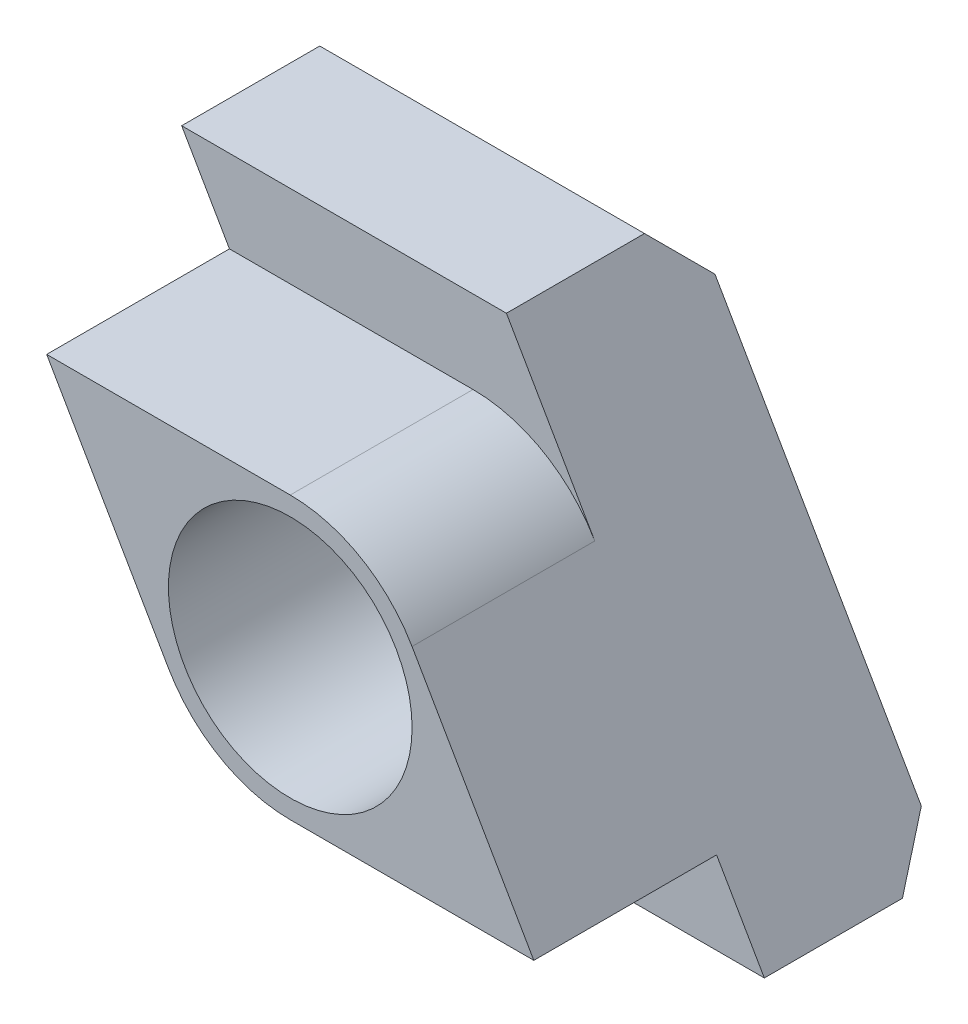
ISO-10303-21;
HEADER;
FILE_DESCRIPTION(('STEP AP214'),'2;1');
FILE_NAME('part.step','',(''),(''),'','','');
FILE_SCHEMA(('AUTOMOTIVE_DESIGN { 1 0 10303 214 1 1 1 1 }'));
ENDSEC;
DATA;
#1=APPLICATION_CONTEXT('core data for automotive mechanical design processes');
#2=APPLICATION_PROTOCOL_DEFINITION('international standard','automotive_design',2000,#1);
#3=PRODUCT_CONTEXT('',#1,'mechanical');
#4=PRODUCT('Part','Part','',(#3));
#5=PRODUCT_RELATED_PRODUCT_CATEGORY('part','',(#4));
#6=PRODUCT_DEFINITION_FORMATION('','',#4);
#7=PRODUCT_DEFINITION_CONTEXT('part definition',#1,'design');
#8=PRODUCT_DEFINITION('design','',#6,#7);
#9=PRODUCT_DEFINITION_SHAPE('','',#8);
#10=(LENGTH_UNIT() NAMED_UNIT(*) SI_UNIT(.MILLI.,.METRE.));
#11=(NAMED_UNIT(*) PLANE_ANGLE_UNIT() SI_UNIT($,.RADIAN.));
#12=(NAMED_UNIT(*) SI_UNIT($,.STERADIAN.) SOLID_ANGLE_UNIT());
#13=UNCERTAINTY_MEASURE_WITH_UNIT(LENGTH_MEASURE(1.E-05),#10,'distance_accuracy_value','');
#14=(GEOMETRIC_REPRESENTATION_CONTEXT(3) GLOBAL_UNCERTAINTY_ASSIGNED_CONTEXT((#13)) GLOBAL_UNIT_ASSIGNED_CONTEXT((#10,
#11,#12)) REPRESENTATION_CONTEXT('',''));
#15=CARTESIAN_POINT('',(0.,0.,0.));
#16=DIRECTION('',(0.,0.,1.));
#17=DIRECTION('',(1.,0.,0.));
#18=AXIS2_PLACEMENT_3D('',#15,#16,#17);
#19=CARTESIAN_POINT('',(5.45595572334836,13.85,0.));
#20=DIRECTION('',(0.,1.,0.));
#21=DIRECTION('',(-1.,0.,0.));
#22=AXIS2_PLACEMENT_3D('',#19,#20,#21);
#23=PLANE('',#22);
#24=DIRECTION('',(-1.,0.,0.));
#25=VECTOR('',#24,1.);
#26=CARTESIAN_POINT('',(23.9888925,13.85,18.));
#27=LINE('',#26,#25);
#28=CARTESIAN_POINT('',(0.,13.85,18.));
#29=VERTEX_POINT('',#28);
#30=CARTESIAN_POINT('',(-23.9888925,13.85,18.));
#31=VERTEX_POINT('',#30);
#32=EDGE_CURVE('E127',#29,#31,#27,.T.);
#33=ORIENTED_EDGE('',*,*,#32,.F.);
#34=DIRECTION('',(0.,0.,1.));
#35=VECTOR('',#34,1.);
#36=CARTESIAN_POINT('',(0.,13.8499975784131,-13.85));
#37=LINE('',#36,#35);
#38=CARTESIAN_POINT('',(0.,13.8499975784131,0.));
#39=VERTEX_POINT('',#38);
#40=EDGE_CURVE('E32',#39,#29,#37,.T.);
#41=ORIENTED_EDGE('',*,*,#40,.F.);
#42=DIRECTION('',(-1.,0.,0.));
#43=VECTOR('',#42,1.);
#44=CARTESIAN_POINT('',(-9.26646838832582,13.85,0.));
#45=LINE('',#44,#43);
#46=CARTESIAN_POINT('',(-23.9888925,13.85,0.));
#47=VERTEX_POINT('',#46);
#48=EDGE_CURVE('E18',#39,#47,#45,.T.);
#49=ORIENTED_EDGE('',*,*,#48,.T.);
#50=DIRECTION('',(0.,0.,1.));
#51=VECTOR('',#50,1.);
#52=CARTESIAN_POINT('',(-23.9888925,13.85,-18.));
#53=LINE('',#52,#51);
#54=EDGE_CURVE('E193',#31,#47,#53,.F.);
#55=ORIENTED_EDGE('',*,*,#54,.F.);
#56=EDGE_LOOP('',(#33,#41,#49,#55));
#57=FACE_BOUND('',#56,.T.);
#58=ADVANCED_FACE('F14',(#57),#23,.T.);
#59=CARTESIAN_POINT('',(-5.45595572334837,-13.85,0.));
#60=DIRECTION('',(0.,-1.,0.));
#61=DIRECTION('',(1.,0.,0.));
#62=AXIS2_PLACEMENT_3D('',#59,#60,#61);
#63=PLANE('',#62);
#64=DIRECTION('',(-1.,0.,0.));
#65=VECTOR('',#64,1.);
#66=CARTESIAN_POINT('',(23.9888925,-13.85,18.));
#67=LINE('',#66,#65);
#68=CARTESIAN_POINT('',(0.,-13.85,18.));
#69=VERTEX_POINT('',#68);
#70=CARTESIAN_POINT('',(23.9888925,-13.85,18.));
#71=VERTEX_POINT('',#70);
#72=EDGE_CURVE('E125',#69,#71,#67,.F.);
#73=ORIENTED_EDGE('',*,*,#72,.F.);
#74=DIRECTION('',(0.,0.,1.));
#75=VECTOR('',#74,1.);
#76=CARTESIAN_POINT('',(0.,-13.8499975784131,-13.85));
#77=LINE('',#76,#75);
#78=CARTESIAN_POINT('',(0.,-13.8499975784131,0.));
#79=VERTEX_POINT('',#78);
#80=EDGE_CURVE('E40',#79,#69,#77,.T.);
#81=ORIENTED_EDGE('',*,*,#80,.F.);
#82=DIRECTION('',(1.,0.,0.));
#83=VECTOR('',#82,1.);
#84=CARTESIAN_POINT('',(9.26646838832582,-13.85,0.));
#85=LINE('',#84,#83);
#86=CARTESIAN_POINT('',(23.9888925,-13.85,0.));
#87=VERTEX_POINT('',#86);
#88=EDGE_CURVE('E183',#79,#87,#85,.T.);
#89=ORIENTED_EDGE('',*,*,#88,.T.);
#90=DIRECTION('',(0.,0.,1.));
#91=VECTOR('',#90,1.);
#92=CARTESIAN_POINT('',(23.9888925,-13.85,-18.));
#93=LINE('',#92,#91);
#94=EDGE_CURVE('E216',#71,#87,#93,.F.);
#95=ORIENTED_EDGE('',*,*,#94,.F.);
#96=EDGE_LOOP('',(#73,#81,#89,#95));
#97=FACE_BOUND('',#96,.T.);
#98=ADVANCED_FACE('F347',(#97),#63,.T.);
#99=CARTESIAN_POINT('',(-28.694295,11.5891477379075,0.));
#100=DIRECTION('',(0.,0.,1.));
#101=DIRECTION('',(1.,0.,0.));
#102=AXIS2_PLACEMENT_3D('',#99,#100,#101);
#103=PLANE('',#102);
#104=ORIENTED_EDGE('',*,*,#48,.F.);
#105=CARTESIAN_POINT('',(0.,0.,0.));
#106=DIRECTION('',(0.,0.,1.));
#107=DIRECTION('',(1.,0.,0.));
#108=AXIS2_PLACEMENT_3D('',#105,#106,#107);
#109=CIRCLE('',#108,13.8499975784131);
#110=CARTESIAN_POINT('',(11.994451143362,6.92499636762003,0.));
#111=VERTEX_POINT('',#110);
#112=EDGE_CURVE('E120',#111,#39,#109,.T.);
#113=ORIENTED_EDGE('',*,*,#112,.F.);
#114=DIRECTION('',(0.499999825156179,-0.866025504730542,0.));
#115=VECTOR('',#114,1.);
#116=CARTESIAN_POINT('',(15.992595,0.,0.));
#117=LINE('',#116,#115);
#118=CARTESIAN_POINT('',(3.290895,22.,0.));
#119=VERTEX_POINT('',#118);
#120=EDGE_CURVE('E118',#119,#111,#117,.T.);
#121=ORIENTED_EDGE('',*,*,#120,.F.);
#122=DIRECTION('',(-1.,0.,0.));
#123=VECTOR('',#122,1.);
#124=CARTESIAN_POINT('',(3.290895,22.,0.));
#125=LINE('',#124,#123);
#126=CARTESIAN_POINT('',(-28.694295,22.,0.));
#127=VERTEX_POINT('',#126);
#128=EDGE_CURVE('E229',#127,#119,#125,.F.);
#129=ORIENTED_EDGE('',*,*,#128,.F.);
#130=DIRECTION('',(-0.499999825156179,0.866025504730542,0.));
#131=VECTOR('',#130,1.);
#132=CARTESIAN_POINT('',(-15.992595,0.,0.));
#133=LINE('',#132,#131);
#134=EDGE_CURVE('E197',#47,#127,#133,.T.);
#135=ORIENTED_EDGE('',*,*,#134,.F.);
#136=EDGE_LOOP('',(#104,#113,#121,#129,#135));
#137=FACE_BOUND('',#136,.T.);
#138=ADVANCED_FACE('F16',(#137),#103,.T.);
#139=CARTESIAN_POINT('',(3.290895,22.,0.));
#140=DIRECTION('',(0.,1.,0.));
#141=DIRECTION('',(0.,0.,-1.));
#142=AXIS2_PLACEMENT_3D('',#139,#140,#141);
#143=PLANE('',#142);
#144=DIRECTION('',(-1.,0.,0.));
#145=VECTOR('',#144,1.);
#146=CARTESIAN_POINT('',(5.831235,22.,-13.6));
#147=LINE('',#146,#145);
#148=CARTESIAN_POINT('',(-28.694295,22.,-13.6));
#149=VERTEX_POINT('',#148);
#150=CARTESIAN_POINT('',(3.290895,22.,-13.6));
#151=VERTEX_POINT('',#150);
#152=EDGE_CURVE('E232',#149,#151,#147,.F.);
#153=ORIENTED_EDGE('',*,*,#152,.F.);
#154=DIRECTION('',(0.,0.,1.));
#155=VECTOR('',#154,1.);
#156=CARTESIAN_POINT('',(-28.694295,22.,-18.));
#157=LINE('',#156,#155);
#158=EDGE_CURVE('E200',#127,#149,#157,.F.);
#159=ORIENTED_EDGE('',*,*,#158,.F.);
#160=ORIENTED_EDGE('',*,*,#128,.T.);
#161=DIRECTION('',(0.,0.,1.));
#162=VECTOR('',#161,1.);
#163=CARTESIAN_POINT('',(3.290895,22.,-18.));
#164=LINE('',#163,#162);
#165=EDGE_CURVE('E217',#151,#119,#164,.T.);
#166=ORIENTED_EDGE('',*,*,#165,.F.);
#167=EDGE_LOOP('',(#153,#159,#160,#166));
#168=FACE_BOUND('',#167,.T.);
#169=ADVANCED_FACE('F360',(#168),#143,.T.);
#170=CARTESIAN_POINT('',(6.03838818,22.,-13.6));
#171=DIRECTION('',(0.,0.707106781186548,-0.707106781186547));
#172=DIRECTION('',(0.,-0.707106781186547,-0.707106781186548));
#173=AXIS2_PLACEMENT_3D('',#170,#171,#172);
#174=PLANE('',#173);
#175=CARTESIAN_POINT('',(5.831235,17.6,-18.));
#176=CARTESIAN_POINT('',(5.7253875,17.7833333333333,-17.8166666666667));
#177=CARTESIAN_POINT('',(5.61954,17.9666666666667,-17.6333333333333));
#178=CARTESIAN_POINT('',(5.407845,18.3333333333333,-17.2666666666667));
#179=CARTESIAN_POINT('',(5.3019975,18.5166666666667,-17.0833333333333));
#180=CARTESIAN_POINT('',(5.0903025,18.8833333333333,-16.7166666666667));
#181=CARTESIAN_POINT('',(4.984455,19.0666666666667,-16.5333333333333));
#182=CARTESIAN_POINT('',(4.77276,19.4333333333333,-16.1666666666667));
#183=CARTESIAN_POINT('',(4.6669125,19.6166666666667,-15.9833333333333));
#184=CARTESIAN_POINT('',(4.4552175,19.9833333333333,-15.6166666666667));
#185=CARTESIAN_POINT('',(4.34937,20.1666666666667,-15.4333333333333));
#186=CARTESIAN_POINT('',(4.137675,20.5333333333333,-15.0666666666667));
#187=CARTESIAN_POINT('',(4.0318275,20.7166666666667,-14.8833333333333));
#188=CARTESIAN_POINT('',(3.8201325,21.0833333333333,-14.5166666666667));
#189=CARTESIAN_POINT('',(3.714285,21.2666666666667,-14.3333333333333));
#190=CARTESIAN_POINT('',(3.50259,21.6333333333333,-13.9666666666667));
#191=CARTESIAN_POINT('',(3.3967425,21.8166666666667,-13.7833333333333));
#192=CARTESIAN_POINT('',(3.290895,22.,-13.6));
#193=B_SPLINE_CURVE_WITH_KNOTS('',3,(#175,#176,#177,#178,#179,#180,#181,#182,#183,#184,#185,
#186,#187,#188,#189,#190,#191,#192),.UNSPECIFIED.,.F.,.F.,(4,2,2,2,2,2,2,2,4),(0.,
0.840138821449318,1.68027764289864,2.52041646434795,3.36055528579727,4.2006941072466,
5.04083292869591,5.88097175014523,6.72111057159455),.UNSPECIFIED.);
#194=CARTESIAN_POINT('',(5.831235,17.6,-18.));
#195=VERTEX_POINT('',#194);
#196=EDGE_CURVE('E226',#195,#151,#193,.T.);
#197=ORIENTED_EDGE('',*,*,#196,.F.);
#198=DIRECTION('',(-1.,0.,0.));
#199=VECTOR('',#198,1.);
#200=CARTESIAN_POINT('',(26.153955,17.6,-18.));
#201=LINE('',#200,#199);
#202=CARTESIAN_POINT('',(-26.153955,17.6,-18.));
#203=VERTEX_POINT('',#202);
#204=EDGE_CURVE('E205',#203,#195,#201,.F.);
#205=ORIENTED_EDGE('',*,*,#204,.F.);
#206=CARTESIAN_POINT('',(-28.694295,22.,-13.6));
#207=CARTESIAN_POINT('',(-28.5884475,21.8166666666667,-13.7833333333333));
#208=CARTESIAN_POINT('',(-28.4826,21.6333333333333,-13.9666666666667));
#209=CARTESIAN_POINT('',(-28.270905,21.2666666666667,-14.3333333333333));
#210=CARTESIAN_POINT('',(-28.1650575,21.0833333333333,-14.5166666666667));
#211=CARTESIAN_POINT('',(-27.9533625,20.7166666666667,-14.8833333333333));
#212=CARTESIAN_POINT('',(-27.847515,20.5333333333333,-15.0666666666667));
#213=CARTESIAN_POINT('',(-27.63582,20.1666666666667,-15.4333333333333));
#214=CARTESIAN_POINT('',(-27.5299725,19.9833333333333,-15.6166666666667));
#215=CARTESIAN_POINT('',(-27.3182775,19.6166666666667,-15.9833333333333));
#216=CARTESIAN_POINT('',(-27.21243,19.4333333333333,-16.1666666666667));
#217=CARTESIAN_POINT('',(-27.000735,19.0666666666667,-16.5333333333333));
#218=CARTESIAN_POINT('',(-26.8948875,18.8833333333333,-16.7166666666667));
#219=CARTESIAN_POINT('',(-26.6831925,18.5166666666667,-17.0833333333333));
#220=CARTESIAN_POINT('',(-26.577345,18.3333333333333,-17.2666666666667));
#221=CARTESIAN_POINT('',(-26.36565,17.9666666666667,-17.6333333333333));
#222=CARTESIAN_POINT('',(-26.2598025,17.7833333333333,-17.8166666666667));
#223=CARTESIAN_POINT('',(-26.153955,17.6,-18.));
#224=B_SPLINE_CURVE_WITH_KNOTS('',3,(#206,#207,#208,#209,#210,#211,#212,#213,#214,#215,#216,
#217,#218,#219,#220,#221,#222,#223),.UNSPECIFIED.,.F.,.F.,(4,2,2,2,2,2,2,2,4),(0.,
0.840138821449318,1.68027764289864,2.52041646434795,3.36055528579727,4.20069410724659,
5.04083292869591,5.88097175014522,6.72111057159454),.UNSPECIFIED.);
#225=EDGE_CURVE('E294',#149,#203,#224,.T.);
#226=ORIENTED_EDGE('',*,*,#225,.F.);
#227=ORIENTED_EDGE('',*,*,#152,.T.);
#228=EDGE_LOOP('',(#197,#205,#226,#227));
#229=FACE_BOUND('',#228,.T.);
#230=ADVANCED_FACE('F358',(#229),#174,.T.);
#231=CARTESIAN_POINT('',(28.90144818,-17.6,-18.));
#232=DIRECTION('',(0.,-0.707106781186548,-0.707106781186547));
#233=DIRECTION('',(0.,-0.707106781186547,0.707106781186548));
#234=AXIS2_PLACEMENT_3D('',#231,#232,#233);
#235=PLANE('',#234);
#236=CARTESIAN_POINT('',(28.694295,-22.,-13.6));
#237=CARTESIAN_POINT('',(28.5884475,-21.8166666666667,-13.7833333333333));
#238=CARTESIAN_POINT('',(28.4826,-21.6333333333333,-13.9666666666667));
#239=CARTESIAN_POINT('',(28.270905,-21.2666666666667,-14.3333333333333));
#240=CARTESIAN_POINT('',(28.1650575,-21.0833333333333,-14.5166666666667));
#241=CARTESIAN_POINT('',(27.9533625,-20.7166666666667,-14.8833333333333));
#242=CARTESIAN_POINT('',(27.847515,-20.5333333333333,-15.0666666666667));
#243=CARTESIAN_POINT('',(27.63582,-20.1666666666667,-15.4333333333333));
#244=CARTESIAN_POINT('',(27.5299725,-19.9833333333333,-15.6166666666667));
#245=CARTESIAN_POINT('',(27.3182775,-19.6166666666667,-15.9833333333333));
#246=CARTESIAN_POINT('',(27.21243,-19.4333333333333,-16.1666666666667));
#247=CARTESIAN_POINT('',(27.000735,-19.0666666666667,-16.5333333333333));
#248=CARTESIAN_POINT('',(26.8948875,-18.8833333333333,-16.7166666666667));
#249=CARTESIAN_POINT('',(26.6831925,-18.5166666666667,-17.0833333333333));
#250=CARTESIAN_POINT('',(26.577345,-18.3333333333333,-17.2666666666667));
#251=CARTESIAN_POINT('',(26.36565,-17.9666666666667,-17.6333333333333));
#252=CARTESIAN_POINT('',(26.2598025,-17.7833333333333,-17.8166666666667));
#253=CARTESIAN_POINT('',(26.153955,-17.6,-18.));
#254=B_SPLINE_CURVE_WITH_KNOTS('',3,(#236,#237,#238,#239,#240,#241,#242,#243,#244,#245,#246,
#247,#248,#249,#250,#251,#252,#253),.UNSPECIFIED.,.F.,.F.,(4,2,2,2,2,2,2,2,4),(0.,
0.840138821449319,1.68027764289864,2.52041646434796,3.36055528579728,4.2006941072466,
5.04083292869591,5.88097175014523,6.72111057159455),.UNSPECIFIED.);
#255=CARTESIAN_POINT('',(28.694295,-22.,-13.6));
#256=VERTEX_POINT('',#255);
#257=CARTESIAN_POINT('',(26.153955,-17.6,-18.));
#258=VERTEX_POINT('',#257);
#259=EDGE_CURVE('E260',#256,#258,#254,.T.);
#260=ORIENTED_EDGE('',*,*,#259,.F.);
#261=DIRECTION('',(-1.,0.,0.));
#262=VECTOR('',#261,1.);
#263=CARTESIAN_POINT('',(28.694295,-22.,-13.6));
#264=LINE('',#263,#262);
#265=CARTESIAN_POINT('',(-3.290895,-22.,-13.6));
#266=VERTEX_POINT('',#265);
#267=EDGE_CURVE('E206',#266,#256,#264,.F.);
#268=ORIENTED_EDGE('',*,*,#267,.F.);
#269=CARTESIAN_POINT('',(-5.831235,-17.6,-18.));
#270=CARTESIAN_POINT('',(-5.7253875,-17.7833333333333,-17.8166666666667));
#271=CARTESIAN_POINT('',(-5.61954,-17.9666666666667,-17.6333333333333));
#272=CARTESIAN_POINT('',(-5.407845,-18.3333333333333,-17.2666666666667));
#273=CARTESIAN_POINT('',(-5.3019975,-18.5166666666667,-17.0833333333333));
#274=CARTESIAN_POINT('',(-5.0903025,-18.8833333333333,-16.7166666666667));
#275=CARTESIAN_POINT('',(-4.984455,-19.0666666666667,-16.5333333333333));
#276=CARTESIAN_POINT('',(-4.77276,-19.4333333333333,-16.1666666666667));
#277=CARTESIAN_POINT('',(-4.6669125,-19.6166666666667,-15.9833333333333));
#278=CARTESIAN_POINT('',(-4.4552175,-19.9833333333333,-15.6166666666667));
#279=CARTESIAN_POINT('',(-4.34937,-20.1666666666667,-15.4333333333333));
#280=CARTESIAN_POINT('',(-4.137675,-20.5333333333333,-15.0666666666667));
#281=CARTESIAN_POINT('',(-4.0318275,-20.7166666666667,-14.8833333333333));
#282=CARTESIAN_POINT('',(-3.8201325,-21.0833333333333,-14.5166666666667));
#283=CARTESIAN_POINT('',(-3.714285,-21.2666666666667,-14.3333333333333));
#284=CARTESIAN_POINT('',(-3.50259,-21.6333333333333,-13.9666666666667));
#285=CARTESIAN_POINT('',(-3.3967425,-21.8166666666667,-13.7833333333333));
#286=CARTESIAN_POINT('',(-3.290895,-22.,-13.6));
#287=B_SPLINE_CURVE_WITH_KNOTS('',3,(#269,#270,#271,#272,#273,#274,#275,#276,#277,#278,#279,
#280,#281,#282,#283,#284,#285,#286),.UNSPECIFIED.,.F.,.F.,(4,2,2,2,2,2,2,2,4),(0.,
0.840138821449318,1.68027764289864,2.52041646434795,3.36055528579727,4.20069410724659,
5.0408329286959,5.88097175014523,6.72111057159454),.UNSPECIFIED.);
#288=CARTESIAN_POINT('',(-5.831235,-17.6,-18.));
#289=VERTEX_POINT('',#288);
#290=EDGE_CURVE('E212',#289,#266,#287,.T.);
#291=ORIENTED_EDGE('',*,*,#290,.F.);
#292=DIRECTION('',(-1.,0.,0.));
#293=VECTOR('',#292,1.);
#294=CARTESIAN_POINT('',(26.153955,-17.6,-18.));
#295=LINE('',#294,#293);
#296=EDGE_CURVE('E186',#258,#289,#295,.T.);
#297=ORIENTED_EDGE('',*,*,#296,.F.);
#298=EDGE_LOOP('',(#260,#268,#291,#297));
#299=FACE_BOUND('',#298,.T.);
#300=ADVANCED_FACE('F320',(#299),#235,.T.);
#301=CARTESIAN_POINT('',(28.694295,-22.,-13.6));
#302=DIRECTION('',(0.,-1.,0.));
#303=DIRECTION('',(0.,0.,1.));
#304=AXIS2_PLACEMENT_3D('',#301,#302,#303);
#305=PLANE('',#304);
#306=ORIENTED_EDGE('',*,*,#267,.T.);
#307=DIRECTION('',(0.,0.,1.));
#308=VECTOR('',#307,1.);
#309=CARTESIAN_POINT('',(28.694295,-22.,-18.));
#310=LINE('',#309,#308);
#311=CARTESIAN_POINT('',(28.694295,-22.,0.));
#312=VERTEX_POINT('',#311);
#313=EDGE_CURVE('E222',#312,#256,#310,.F.);
#314=ORIENTED_EDGE('',*,*,#313,.F.);
#315=DIRECTION('',(1.,0.,0.));
#316=VECTOR('',#315,1.);
#317=CARTESIAN_POINT('',(9.71391352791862,-22.,0.));
#318=LINE('',#317,#316);
#319=CARTESIAN_POINT('',(-3.290895,-22.,0.));
#320=VERTEX_POINT('',#319);
#321=EDGE_CURVE('E203',#320,#312,#318,.T.);
#322=ORIENTED_EDGE('',*,*,#321,.F.);
#323=DIRECTION('',(0.,0.,1.));
#324=VECTOR('',#323,1.);
#325=CARTESIAN_POINT('',(-3.290895,-22.,-18.));
#326=LINE('',#325,#324);
#327=EDGE_CURVE('E209',#266,#320,#326,.T.);
#328=ORIENTED_EDGE('',*,*,#327,.F.);
#329=EDGE_LOOP('',(#306,#314,#322,#328));
#330=FACE_BOUND('',#329,.T.);
#331=ADVANCED_FACE('F325',(#330),#305,.T.);
#332=CARTESIAN_POINT('',(-9.26646794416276,-22.,0.));
#333=DIRECTION('',(0.,0.,1.));
#334=DIRECTION('',(1.,0.,0.));
#335=AXIS2_PLACEMENT_3D('',#332,#333,#334);
#336=PLANE('',#335);
#337=ORIENTED_EDGE('',*,*,#88,.F.);
#338=CARTESIAN_POINT('',(0.,0.,0.));
#339=DIRECTION('',(0.,0.,1.));
#340=DIRECTION('',(1.,0.,0.));
#341=AXIS2_PLACEMENT_3D('',#338,#339,#340);
#342=CIRCLE('',#341,13.8499975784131);
#343=CARTESIAN_POINT('',(-11.994451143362,-6.92499636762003,0.));
#344=VERTEX_POINT('',#343);
#345=EDGE_CURVE('E233',#344,#79,#342,.T.);
#346=ORIENTED_EDGE('',*,*,#345,.F.);
#347=DIRECTION('',(-0.499999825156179,0.866025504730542,0.));
#348=VECTOR('',#347,1.);
#349=CARTESIAN_POINT('',(-15.992595,0.,0.));
#350=LINE('',#349,#348);
#351=EDGE_CURVE('E191',#320,#344,#350,.T.);
#352=ORIENTED_EDGE('',*,*,#351,.F.);
#353=ORIENTED_EDGE('',*,*,#321,.T.);
#354=DIRECTION('',(0.499999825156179,-0.866025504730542,0.));
#355=VECTOR('',#354,1.);
#356=CARTESIAN_POINT('',(15.992595,0.,0.));
#357=LINE('',#356,#355);
#358=EDGE_CURVE('E185',#87,#312,#357,.T.);
#359=ORIENTED_EDGE('',*,*,#358,.F.);
#360=EDGE_LOOP('',(#337,#346,#352,#353,#359));
#361=FACE_BOUND('',#360,.T.);
#362=ADVANCED_FACE('F332',(#361),#336,.T.);
#363=CARTESIAN_POINT('',(26.46780246,17.6,-18.));
#364=DIRECTION('',(0.,0.,-1.));
#365=DIRECTION('',(0.,-1.,0.));
#366=AXIS2_PLACEMENT_3D('',#363,#364,#365);
#367=PLANE('',#366);
#368=CARTESIAN_POINT('',(0.,0.,-18.));
#369=DIRECTION('',(0.,0.,-1.));
#370=DIRECTION('',(-1.,0.,0.));
#371=AXIS2_PLACEMENT_3D('',#368,#369,#370);
#372=CIRCLE('',#371,12.);
#373=CARTESIAN_POINT('',(-12.,0.,-18.));
#374=VERTEX_POINT('',#373);
#375=EDGE_CURVE('E129',#374,#374,#372,.T.);
#376=ORIENTED_EDGE('',*,*,#375,.F.);
#377=EDGE_LOOP('',(#376));
#378=FACE_BOUND('',#377,.T.);
#379=DIRECTION('',(-0.499999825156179,0.866025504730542,0.));
#380=VECTOR('',#379,1.);
#381=CARTESIAN_POINT('',(15.992595,0.,-18.));
#382=LINE('',#381,#380);
#383=EDGE_CURVE('E238',#258,#195,#382,.T.);
#384=ORIENTED_EDGE('',*,*,#383,.F.);
#385=ORIENTED_EDGE('',*,*,#296,.T.);
#386=DIRECTION('',(0.499999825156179,-0.866025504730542,0.));
#387=VECTOR('',#386,1.);
#388=CARTESIAN_POINT('',(-15.992595,0.,-18.));
#389=LINE('',#388,#387);
#390=EDGE_CURVE('E276',#203,#289,#389,.T.);
#391=ORIENTED_EDGE('',*,*,#390,.F.);
#392=ORIENTED_EDGE('',*,*,#204,.T.);
#393=EDGE_LOOP('',(#384,#385,#391,#392));
#394=FACE_BOUND('',#393,.T.);
#395=ADVANCED_FACE('F313',(#378,#394),#367,.T.);
#396=CARTESIAN_POINT('',(28.694295,-22.,-18.));
#397=DIRECTION('',(0.866025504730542,0.499999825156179,0.));
#398=DIRECTION('',(-0.499999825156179,0.866025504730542,0.));
#399=AXIS2_PLACEMENT_3D('',#396,#397,#398);
#400=PLANE('',#399);
#401=DIRECTION('',(0.,0.,1.));
#402=VECTOR('',#401,1.);
#403=CARTESIAN_POINT('',(11.9944490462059,6.924995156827,-13.85));
#404=LINE('',#403,#402);
#405=CARTESIAN_POINT('',(11.9944490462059,6.924995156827,18.));
#406=VERTEX_POINT('',#405);
#407=EDGE_CURVE('E107',#111,#406,#404,.T.);
#408=ORIENTED_EDGE('',*,*,#407,.T.);
#409=CARTESIAN_POINT('',(23.9888925,-13.85,18.));
#410=CARTESIAN_POINT('',(23.3754581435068,-12.7875000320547,18.));
#411=CARTESIAN_POINT('',(22.7620237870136,-11.7250000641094,18.));
#412=CARTESIAN_POINT('',(21.5351550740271,-9.6000001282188,18.));
#413=CARTESIAN_POINT('',(20.9217207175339,-8.5375001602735,18.));
#414=CARTESIAN_POINT('',(19.6948520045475,-6.41250022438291,18.));
#415=CARTESIAN_POINT('',(19.0814176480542,-5.35000025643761,18.));
#416=CARTESIAN_POINT('',(17.8545489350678,-3.22500032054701,18.));
#417=CARTESIAN_POINT('',(17.2411145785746,-2.16250035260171,18.));
#418=CARTESIAN_POINT('',(16.0142458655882,-0.0375004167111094,18.));
#419=CARTESIAN_POINT('',(15.4008115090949,1.02499955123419,18.));
#420=CARTESIAN_POINT('',(14.1739427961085,3.14999948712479,18.));
#421=CARTESIAN_POINT('',(13.5605084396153,4.21249945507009,18.));
#422=CARTESIAN_POINT('',(12.3336397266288,6.33749939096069,18.));
#423=CARTESIAN_POINT('',(11.7202053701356,7.39999935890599,18.));
#424=CARTESIAN_POINT('',(10.4933366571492,9.52499929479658,18.));
#425=CARTESIAN_POINT('',(9.87990230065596,10.5874992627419,18.));
#426=CARTESIAN_POINT('',(9.26646794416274,11.6499992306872,18.));
#427=B_SPLINE_CURVE_WITH_KNOTS('',3,(#409,#410,#411,#412,#413,#414,#415,#416,#417,#418,#419,
#420,#421,#422,#423,#424,#425,#426),.UNSPECIFIED.,.F.,.F.,(4,2,2,2,2,2,2,2,4),(0.,
3.68060742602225,7.3612148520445,11.0418222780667,14.722429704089,18.4030371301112,
22.0836445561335,25.7642519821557,29.444859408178),.UNSPECIFIED.);
#428=EDGE_CURVE('E116',#71,#406,#427,.T.);
#429=ORIENTED_EDGE('',*,*,#428,.F.);
#430=ORIENTED_EDGE('',*,*,#94,.T.);
#431=ORIENTED_EDGE('',*,*,#358,.T.);
#432=ORIENTED_EDGE('',*,*,#313,.T.);
#433=ORIENTED_EDGE('',*,*,#259,.T.);
#434=ORIENTED_EDGE('',*,*,#383,.T.);
#435=ORIENTED_EDGE('',*,*,#196,.T.);
#436=ORIENTED_EDGE('',*,*,#165,.T.);
#437=ORIENTED_EDGE('',*,*,#120,.T.);
#438=EDGE_LOOP('',(#408,#429,#430,#431,#432,#433,#434,#435,#436,#437));
#439=FACE_BOUND('',#438,.T.);
#440=ADVANCED_FACE('F114',(#439),#400,.T.);
#441=CARTESIAN_POINT('',(-28.694295,22.,-18.));
#442=DIRECTION('',(-0.866025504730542,-0.499999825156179,0.));
#443=DIRECTION('',(0.499999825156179,-0.866025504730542,0.));
#444=AXIS2_PLACEMENT_3D('',#441,#442,#443);
#445=PLANE('',#444);
#446=DIRECTION('',(0.,0.,1.));
#447=VECTOR('',#446,1.);
#448=CARTESIAN_POINT('',(-11.9944490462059,-6.924995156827,-13.85));
#449=LINE('',#448,#447);
#450=CARTESIAN_POINT('',(-11.9944490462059,-6.924995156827,18.));
#451=VERTEX_POINT('',#450);
#452=EDGE_CURVE('E329',#344,#451,#449,.T.);
#453=ORIENTED_EDGE('',*,*,#452,.T.);
#454=CARTESIAN_POINT('',(-23.9888925,13.85,18.));
#455=CARTESIAN_POINT('',(-23.3754581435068,12.7875000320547,18.));
#456=CARTESIAN_POINT('',(-22.7620237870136,11.7250000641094,18.));
#457=CARTESIAN_POINT('',(-21.5351550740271,9.6000001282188,18.));
#458=CARTESIAN_POINT('',(-20.9217207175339,8.5375001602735,18.));
#459=CARTESIAN_POINT('',(-19.6948520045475,6.41250022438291,18.));
#460=CARTESIAN_POINT('',(-19.0814176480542,5.35000025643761,18.));
#461=CARTESIAN_POINT('',(-17.8545489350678,3.22500032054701,18.));
#462=CARTESIAN_POINT('',(-17.2411145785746,2.16250035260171,18.));
#463=CARTESIAN_POINT('',(-16.0142458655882,0.0375004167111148,18.));
#464=CARTESIAN_POINT('',(-15.4008115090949,-1.02499955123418,18.));
#465=CARTESIAN_POINT('',(-14.1739427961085,-3.14999948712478,18.));
#466=CARTESIAN_POINT('',(-13.5605084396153,-4.21249945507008,18.));
#467=CARTESIAN_POINT('',(-12.3336397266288,-6.33749939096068,18.));
#468=CARTESIAN_POINT('',(-11.7202053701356,-7.39999935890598,18.));
#469=CARTESIAN_POINT('',(-10.4933366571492,-9.52499929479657,18.));
#470=CARTESIAN_POINT('',(-9.87990230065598,-10.5874992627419,18.));
#471=CARTESIAN_POINT('',(-9.26646794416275,-11.6499992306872,18.));
#472=B_SPLINE_CURVE_WITH_KNOTS('',3,(#454,#455,#456,#457,#458,#459,#460,#461,#462,#463,#464,
#465,#466,#467,#468,#469,#470,#471),.UNSPECIFIED.,.F.,.F.,(4,2,2,2,2,2,2,2,4),(0.,
3.68060742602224,7.36121485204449,11.0418222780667,14.722429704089,18.4030371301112,
22.0836445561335,25.7642519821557,29.444859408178),.UNSPECIFIED.);
#473=EDGE_CURVE('E24',#31,#451,#472,.T.);
#474=ORIENTED_EDGE('',*,*,#473,.F.);
#475=ORIENTED_EDGE('',*,*,#54,.T.);
#476=ORIENTED_EDGE('',*,*,#134,.T.);
#477=ORIENTED_EDGE('',*,*,#158,.T.);
#478=ORIENTED_EDGE('',*,*,#225,.T.);
#479=ORIENTED_EDGE('',*,*,#390,.T.);
#480=ORIENTED_EDGE('',*,*,#290,.T.);
#481=ORIENTED_EDGE('',*,*,#327,.T.);
#482=ORIENTED_EDGE('',*,*,#351,.T.);
#483=EDGE_LOOP('',(#453,#474,#475,#476,#477,#478,#479,#480,#481,#482));
#484=FACE_BOUND('',#483,.T.);
#485=ADVANCED_FACE('F287',(#484),#445,.T.);
#486=CARTESIAN_POINT('',(24.27675921,-13.85,18.));
#487=DIRECTION('',(0.,0.,1.));
#488=DIRECTION('',(0.,1.,0.));
#489=AXIS2_PLACEMENT_3D('',#486,#487,#488);
#490=PLANE('',#489);
#491=CARTESIAN_POINT('',(0.,0.,18.));
#492=DIRECTION('',(0.,0.,-1.));
#493=DIRECTION('',(1.,0.,0.));
#494=AXIS2_PLACEMENT_3D('',#491,#492,#493);
#495=CIRCLE('',#494,13.8499975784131);
#496=EDGE_CURVE('E104',#29,#406,#495,.T.);
#497=ORIENTED_EDGE('',*,*,#496,.F.);
#498=ORIENTED_EDGE('',*,*,#32,.T.);
#499=ORIENTED_EDGE('',*,*,#473,.T.);
#500=CARTESIAN_POINT('',(0.,0.,18.));
#501=DIRECTION('',(0.,0.,-1.));
#502=DIRECTION('',(1.,0.,0.));
#503=AXIS2_PLACEMENT_3D('',#500,#501,#502);
#504=CIRCLE('',#503,13.8499975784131);
#505=EDGE_CURVE('E336',#69,#451,#504,.T.);
#506=ORIENTED_EDGE('',*,*,#505,.F.);
#507=ORIENTED_EDGE('',*,*,#72,.T.);
#508=ORIENTED_EDGE('',*,*,#428,.T.);
#509=EDGE_LOOP('',(#497,#498,#499,#506,#507,#508));
#510=FACE_BOUND('',#509,.T.);
#511=CARTESIAN_POINT('',(0.,0.,18.));
#512=DIRECTION('',(0.,0.,1.));
#513=DIRECTION('',(1.,0.,0.));
#514=AXIS2_PLACEMENT_3D('',#511,#512,#513);
#515=CIRCLE('',#514,12.);
#516=CARTESIAN_POINT('',(12.,0.,18.));
#517=VERTEX_POINT('',#516);
#518=EDGE_CURVE('E9',#517,#517,#515,.T.);
#519=ORIENTED_EDGE('',*,*,#518,.F.);
#520=EDGE_LOOP('',(#519));
#521=FACE_BOUND('',#520,.T.);
#522=ADVANCED_FACE('F122',(#510,#521),#490,.T.);
#523=CARTESIAN_POINT('',(0.,0.,-18.0001030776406));
#524=DIRECTION('',(0.,0.,1.));
#525=DIRECTION('',(1.,0.,0.));
#526=AXIS2_PLACEMENT_3D('',#523,#524,#525);
#527=CYLINDRICAL_SURFACE('',#526,12.);
#528=ORIENTED_EDGE('',*,*,#375,.T.);
#529=EDGE_LOOP('',(#528));
#530=FACE_BOUND('',#529,.T.);
#531=ORIENTED_EDGE('',*,*,#518,.T.);
#532=EDGE_LOOP('',(#531));
#533=FACE_BOUND('',#532,.T.);
#534=ADVANCED_FACE('F152',(#530,#533),#527,.F.);
#535=CARTESIAN_POINT('',(0.,0.,-13.85));
#536=DIRECTION('',(0.,0.,1.));
#537=DIRECTION('',(1.,0.,0.));
#538=AXIS2_PLACEMENT_3D('',#535,#536,#537);
#539=CYLINDRICAL_SURFACE('',#538,13.8499975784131);
#540=ORIENTED_EDGE('',*,*,#345,.T.);
#541=ORIENTED_EDGE('',*,*,#80,.T.);
#542=ORIENTED_EDGE('',*,*,#505,.T.);
#543=ORIENTED_EDGE('',*,*,#452,.F.);
#544=EDGE_LOOP('',(#540,#541,#542,#543));
#545=FACE_BOUND('',#544,.T.);
#546=ADVANCED_FACE('F335',(#545),#539,.T.);
#547=CARTESIAN_POINT('',(0.,0.,-13.85));
#548=DIRECTION('',(0.,0.,1.));
#549=DIRECTION('',(1.,0.,0.));
#550=AXIS2_PLACEMENT_3D('',#547,#548,#549);
#551=CYLINDRICAL_SURFACE('',#550,13.8499975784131);
#552=ORIENTED_EDGE('',*,*,#112,.T.);
#553=ORIENTED_EDGE('',*,*,#40,.T.);
#554=ORIENTED_EDGE('',*,*,#496,.T.);
#555=ORIENTED_EDGE('',*,*,#407,.F.);
#556=EDGE_LOOP('',(#552,#553,#554,#555));
#557=FACE_BOUND('',#556,.T.);
#558=ADVANCED_FACE('F106',(#557),#551,.T.);
#559=CLOSED_SHELL('',(#58,#98,#138,#169,#230,#300,#331,#362,#395,#440,#485,#522,#534,#546,#558));
#560=MANIFOLD_SOLID_BREP('B1',#559);
#561=ADVANCED_BREP_SHAPE_REPRESENTATION('',(#18,#560),#14);
#562=SHAPE_DEFINITION_REPRESENTATION(#9,#561);
ENDSEC;
END-ISO-10303-21;
